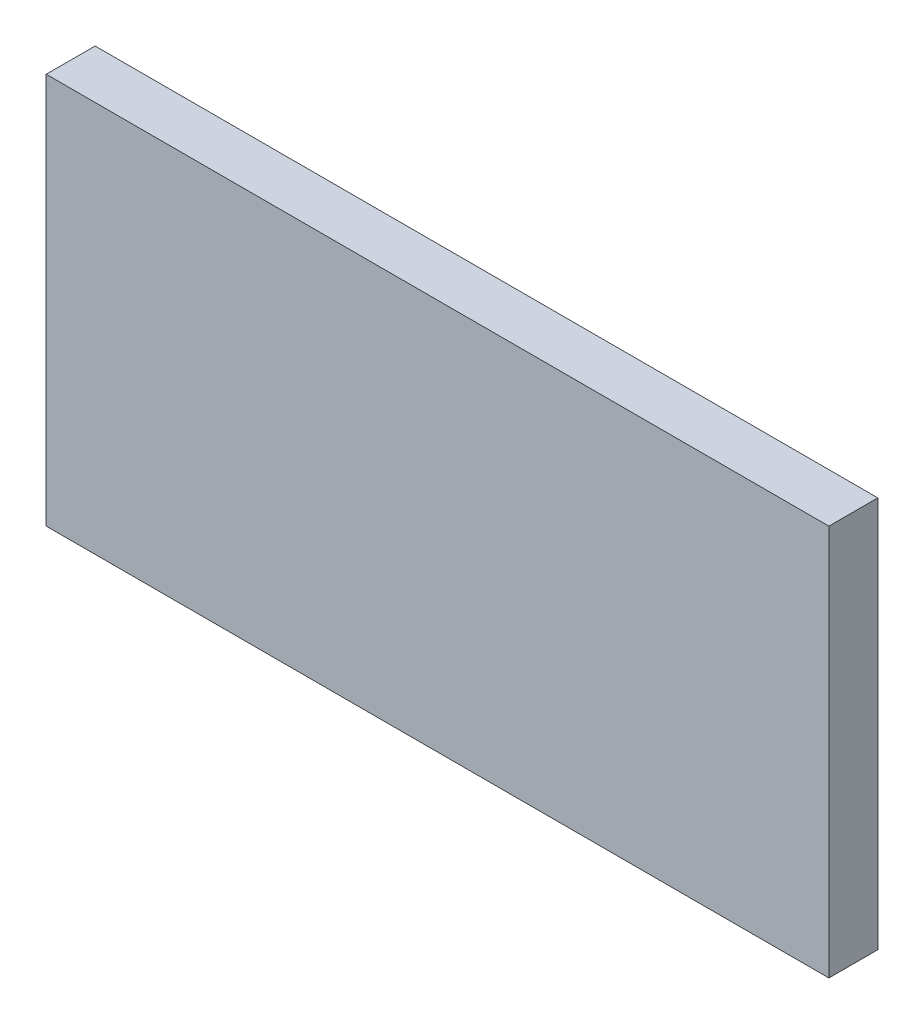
ISO-10303-21;
HEADER;
FILE_DESCRIPTION(('STEP AP214'),'2;1');
FILE_NAME('part.step','',(''),(''),'','','');
FILE_SCHEMA(('AUTOMOTIVE_DESIGN { 1 0 10303 214 1 1 1 1 }'));
ENDSEC;
DATA;
#1=APPLICATION_CONTEXT('core data for automotive mechanical design processes');
#2=APPLICATION_PROTOCOL_DEFINITION('international standard','automotive_design',2000,#1);
#3=PRODUCT_CONTEXT('',#1,'mechanical');
#4=PRODUCT('Part','Part','',(#3));
#5=PRODUCT_RELATED_PRODUCT_CATEGORY('part','',(#4));
#6=PRODUCT_DEFINITION_FORMATION('','',#4);
#7=PRODUCT_DEFINITION_CONTEXT('part definition',#1,'design');
#8=PRODUCT_DEFINITION('design','',#6,#7);
#9=PRODUCT_DEFINITION_SHAPE('','',#8);
#10=(LENGTH_UNIT() NAMED_UNIT(*) SI_UNIT(.MILLI.,.METRE.));
#11=(NAMED_UNIT(*) PLANE_ANGLE_UNIT() SI_UNIT($,.RADIAN.));
#12=(NAMED_UNIT(*) SI_UNIT($,.STERADIAN.) SOLID_ANGLE_UNIT());
#13=UNCERTAINTY_MEASURE_WITH_UNIT(LENGTH_MEASURE(1.E-05),#10,'distance_accuracy_value','');
#14=(GEOMETRIC_REPRESENTATION_CONTEXT(3) GLOBAL_UNCERTAINTY_ASSIGNED_CONTEXT((#13)) GLOBAL_UNIT_ASSIGNED_CONTEXT((#10,
#11,#12)) REPRESENTATION_CONTEXT('',''));
#15=CARTESIAN_POINT('',(0.,0.,0.));
#16=DIRECTION('',(0.,0.,1.));
#17=DIRECTION('',(1.,0.,0.));
#18=AXIS2_PLACEMENT_3D('',#15,#16,#17);
#19=CARTESIAN_POINT('',(0.,0.,0.));
#20=DIRECTION('',(0.,0.,1.));
#21=DIRECTION('',(1.,0.,0.));
#22=AXIS2_PLACEMENT_3D('',#19,#20,#21);
#23=PLANE('',#22);
#24=DIRECTION('',(0.,-1.,0.));
#25=VECTOR('',#24,1.);
#26=CARTESIAN_POINT('',(160.,40.,0.));
#27=LINE('',#26,#25);
#28=CARTESIAN_POINT('',(160.,40.,0.));
#29=VERTEX_POINT('',#28);
#30=CARTESIAN_POINT('',(160.,20.,0.));
#31=VERTEX_POINT('',#30);
#32=EDGE_CURVE('E55',#29,#31,#27,.T.);
#33=ORIENTED_EDGE('',*,*,#32,.F.);
#34=DIRECTION('',(1.,0.,0.));
#35=VECTOR('',#34,1.);
#36=CARTESIAN_POINT('',(160.,40.,0.));
#37=LINE('',#36,#35);
#38=CARTESIAN_POINT('',(100.,40.,0.));
#39=VERTEX_POINT('',#38);
#40=EDGE_CURVE('E204',#39,#29,#37,.T.);
#41=ORIENTED_EDGE('',*,*,#40,.F.);
#42=DIRECTION('',(0.,-1.,0.));
#43=VECTOR('',#42,1.);
#44=CARTESIAN_POINT('',(100.,40.,0.));
#45=LINE('',#44,#43);
#46=CARTESIAN_POINT('',(100.,20.,0.));
#47=VERTEX_POINT('',#46);
#48=EDGE_CURVE('E215',#39,#47,#45,.T.);
#49=ORIENTED_EDGE('',*,*,#48,.T.);
#50=DIRECTION('',(1.,0.,0.));
#51=VECTOR('',#50,1.);
#52=CARTESIAN_POINT('',(160.,20.,0.));
#53=LINE('',#52,#51);
#54=EDGE_CURVE('E202',#47,#31,#53,.T.);
#55=ORIENTED_EDGE('',*,*,#54,.T.);
#56=EDGE_LOOP('',(#33,#41,#49,#55));
#57=FACE_BOUND('',#56,.T.);
#58=DIRECTION('',(0.,-1.,0.));
#59=VECTOR('',#58,1.);
#60=CARTESIAN_POINT('',(-240.,40.,0.));
#61=LINE('',#60,#59);
#62=CARTESIAN_POINT('',(-240.,40.,0.));
#63=VERTEX_POINT('',#62);
#64=CARTESIAN_POINT('',(-240.,20.,0.));
#65=VERTEX_POINT('',#64);
#66=EDGE_CURVE('E302',#63,#65,#61,.T.);
#67=ORIENTED_EDGE('',*,*,#66,.F.);
#68=DIRECTION('',(1.,0.,0.));
#69=VECTOR('',#68,1.);
#70=CARTESIAN_POINT('',(-240.,40.,0.));
#71=LINE('',#70,#69);
#72=CARTESIAN_POINT('',(-300.,40.,0.));
#73=VERTEX_POINT('',#72);
#74=EDGE_CURVE('E276',#73,#63,#71,.T.);
#75=ORIENTED_EDGE('',*,*,#74,.F.);
#76=DIRECTION('',(0.,-1.,0.));
#77=VECTOR('',#76,1.);
#78=CARTESIAN_POINT('',(-300.,40.,0.));
#79=LINE('',#78,#77);
#80=CARTESIAN_POINT('',(-300.,20.,0.));
#81=VERTEX_POINT('',#80);
#82=EDGE_CURVE('E287',#73,#81,#79,.T.);
#83=ORIENTED_EDGE('',*,*,#82,.T.);
#84=DIRECTION('',(1.,0.,0.));
#85=VECTOR('',#84,1.);
#86=CARTESIAN_POINT('',(-240.,20.,0.));
#87=LINE('',#86,#85);
#88=EDGE_CURVE('E273',#81,#65,#87,.T.);
#89=ORIENTED_EDGE('',*,*,#88,.T.);
#90=EDGE_LOOP('',(#67,#75,#83,#89));
#91=FACE_BOUND('',#90,.T.);
#92=DIRECTION('',(0.,-1.,0.));
#93=VECTOR('',#92,1.);
#94=CARTESIAN_POINT('',(-400.,-200.,0.));
#95=LINE('',#94,#93);
#96=CARTESIAN_POINT('',(-400.,200.,0.));
#97=VERTEX_POINT('',#96);
#98=CARTESIAN_POINT('',(-400.,-200.,0.));
#99=VERTEX_POINT('',#98);
#100=EDGE_CURVE('E305',#97,#99,#95,.T.);
#101=ORIENTED_EDGE('',*,*,#100,.F.);
#102=DIRECTION('',(-1.,0.,0.));
#103=VECTOR('',#102,1.);
#104=CARTESIAN_POINT('',(400.,200.,0.));
#105=LINE('',#104,#103);
#106=CARTESIAN_POINT('',(400.,200.,0.));
#107=VERTEX_POINT('',#106);
#108=EDGE_CURVE('E310',#107,#97,#105,.T.);
#109=ORIENTED_EDGE('',*,*,#108,.F.);
#110=DIRECTION('',(0.,1.,0.));
#111=VECTOR('',#110,1.);
#112=CARTESIAN_POINT('',(400.,-200.,0.));
#113=LINE('',#112,#111);
#114=CARTESIAN_POINT('',(400.,-200.,0.));
#115=VERTEX_POINT('',#114);
#116=EDGE_CURVE('E321',#115,#107,#113,.T.);
#117=ORIENTED_EDGE('',*,*,#116,.F.);
#118=DIRECTION('',(1.,0.,0.));
#119=VECTOR('',#118,1.);
#120=CARTESIAN_POINT('',(400.,-200.,0.));
#121=LINE('',#120,#119);
#122=EDGE_CURVE('E319',#99,#115,#121,.T.);
#123=ORIENTED_EDGE('',*,*,#122,.F.);
#124=EDGE_LOOP('',(#101,#109,#117,#123));
#125=FACE_BOUND('',#124,.T.);
#126=DIRECTION('',(1.,0.,0.));
#127=VECTOR('',#126,1.);
#128=CARTESIAN_POINT('',(-240.,-40.,0.));
#129=LINE('',#128,#127);
#130=CARTESIAN_POINT('',(-300.,-40.,0.));
#131=VERTEX_POINT('',#130);
#132=CARTESIAN_POINT('',(-240.,-40.,0.));
#133=VERTEX_POINT('',#132);
#134=EDGE_CURVE('E238',#131,#133,#129,.T.);
#135=ORIENTED_EDGE('',*,*,#134,.T.);
#136=DIRECTION('',(0.,1.,0.));
#137=VECTOR('',#136,1.);
#138=CARTESIAN_POINT('',(-240.,-40.,0.));
#139=LINE('',#138,#137);
#140=CARTESIAN_POINT('',(-240.,-20.,0.));
#141=VERTEX_POINT('',#140);
#142=EDGE_CURVE('E251',#133,#141,#139,.T.);
#143=ORIENTED_EDGE('',*,*,#142,.T.);
#144=DIRECTION('',(1.,0.,0.));
#145=VECTOR('',#144,1.);
#146=CARTESIAN_POINT('',(-240.,-20.,0.));
#147=LINE('',#146,#145);
#148=CARTESIAN_POINT('',(-300.,-20.,0.));
#149=VERTEX_POINT('',#148);
#150=EDGE_CURVE('E235',#149,#141,#147,.T.);
#151=ORIENTED_EDGE('',*,*,#150,.F.);
#152=DIRECTION('',(0.,1.,0.));
#153=VECTOR('',#152,1.);
#154=CARTESIAN_POINT('',(-300.,-40.,0.));
#155=LINE('',#154,#153);
#156=EDGE_CURVE('E266',#131,#149,#155,.T.);
#157=ORIENTED_EDGE('',*,*,#156,.F.);
#158=EDGE_LOOP('',(#135,#143,#151,#157));
#159=FACE_BOUND('',#158,.T.);
#160=DIRECTION('',(1.,0.,0.));
#161=VECTOR('',#160,1.);
#162=CARTESIAN_POINT('',(160.,-40.,0.));
#163=LINE('',#162,#161);
#164=CARTESIAN_POINT('',(100.,-40.,0.));
#165=VERTEX_POINT('',#164);
#166=CARTESIAN_POINT('',(160.,-40.,0.));
#167=VERTEX_POINT('',#166);
#168=EDGE_CURVE('E171',#165,#167,#163,.T.);
#169=ORIENTED_EDGE('',*,*,#168,.T.);
#170=DIRECTION('',(0.,1.,0.));
#171=VECTOR('',#170,1.);
#172=CARTESIAN_POINT('',(160.,-40.,0.));
#173=LINE('',#172,#171);
#174=CARTESIAN_POINT('',(160.,-20.,0.));
#175=VERTEX_POINT('',#174);
#176=EDGE_CURVE('E500',#167,#175,#173,.T.);
#177=ORIENTED_EDGE('',*,*,#176,.T.);
#178=DIRECTION('',(1.,0.,0.));
#179=VECTOR('',#178,1.);
#180=CARTESIAN_POINT('',(160.,-20.,0.));
#181=LINE('',#180,#179);
#182=CARTESIAN_POINT('',(100.,-20.,0.));
#183=VERTEX_POINT('',#182);
#184=EDGE_CURVE('E191',#183,#175,#181,.T.);
#185=ORIENTED_EDGE('',*,*,#184,.F.);
#186=DIRECTION('',(0.,1.,0.));
#187=VECTOR('',#186,1.);
#188=CARTESIAN_POINT('',(100.,-40.,0.));
#189=LINE('',#188,#187);
#190=EDGE_CURVE('E186',#165,#183,#189,.T.);
#191=ORIENTED_EDGE('',*,*,#190,.F.);
#192=EDGE_LOOP('',(#169,#177,#185,#191));
#193=FACE_BOUND('',#192,.T.);
#194=ADVANCED_FACE('F32',(#57,#91,#125,#159,#193),#23,.F.);
#195=CARTESIAN_POINT('',(-400.,-200.,50.));
#196=DIRECTION('',(1.,0.,0.));
#197=DIRECTION('',(0.,0.,-1.));
#198=AXIS2_PLACEMENT_3D('',#195,#196,#197);
#199=PLANE('',#198);
#200=ORIENTED_EDGE('',*,*,#100,.T.);
#201=DIRECTION('',(0.,0.,-1.));
#202=VECTOR('',#201,1.);
#203=CARTESIAN_POINT('',(-400.,-200.,50.));
#204=LINE('',#203,#202);
#205=CARTESIAN_POINT('',(-400.,-200.,50.));
#206=VERTEX_POINT('',#205);
#207=EDGE_CURVE('E11',#206,#99,#204,.T.);
#208=ORIENTED_EDGE('',*,*,#207,.F.);
#209=DIRECTION('',(0.,-1.,0.));
#210=VECTOR('',#209,1.);
#211=CARTESIAN_POINT('',(-400.,-200.,50.));
#212=LINE('',#211,#210);
#213=CARTESIAN_POINT('',(-400.,200.,50.));
#214=VERTEX_POINT('',#213);
#215=EDGE_CURVE('E306',#214,#206,#212,.T.);
#216=ORIENTED_EDGE('',*,*,#215,.F.);
#217=DIRECTION('',(0.,0.,-1.));
#218=VECTOR('',#217,1.);
#219=CARTESIAN_POINT('',(-400.,200.,50.));
#220=LINE('',#219,#218);
#221=EDGE_CURVE('E316',#214,#97,#220,.T.);
#222=ORIENTED_EDGE('',*,*,#221,.T.);
#223=EDGE_LOOP('',(#200,#208,#216,#222));
#224=FACE_BOUND('',#223,.T.);
#225=ADVANCED_FACE('F34',(#224),#199,.F.);
#226=CARTESIAN_POINT('',(400.,-200.,50.));
#227=DIRECTION('',(0.,1.,0.));
#228=DIRECTION('',(-1.,0.,0.));
#229=AXIS2_PLACEMENT_3D('',#226,#227,#228);
#230=PLANE('',#229);
#231=ORIENTED_EDGE('',*,*,#122,.T.);
#232=DIRECTION('',(0.,0.,-1.));
#233=VECTOR('',#232,1.);
#234=CARTESIAN_POINT('',(400.,-200.,50.));
#235=LINE('',#234,#233);
#236=CARTESIAN_POINT('',(400.,-200.,50.));
#237=VERTEX_POINT('',#236);
#238=EDGE_CURVE('E40',#237,#115,#235,.T.);
#239=ORIENTED_EDGE('',*,*,#238,.F.);
#240=DIRECTION('',(1.,0.,0.));
#241=VECTOR('',#240,1.);
#242=CARTESIAN_POINT('',(400.,-200.,50.));
#243=LINE('',#242,#241);
#244=EDGE_CURVE('E309',#206,#237,#243,.T.);
#245=ORIENTED_EDGE('',*,*,#244,.F.);
#246=ORIENTED_EDGE('',*,*,#207,.T.);
#247=EDGE_LOOP('',(#231,#239,#245,#246));
#248=FACE_BOUND('',#247,.T.);
#249=ADVANCED_FACE('F349',(#248),#230,.F.);
#250=CARTESIAN_POINT('',(400.,-200.,50.));
#251=DIRECTION('',(-1.,0.,0.));
#252=DIRECTION('',(0.,0.,1.));
#253=AXIS2_PLACEMENT_3D('',#250,#251,#252);
#254=PLANE('',#253);
#255=ORIENTED_EDGE('',*,*,#116,.T.);
#256=DIRECTION('',(0.,0.,-1.));
#257=VECTOR('',#256,1.);
#258=CARTESIAN_POINT('',(400.,200.,50.));
#259=LINE('',#258,#257);
#260=CARTESIAN_POINT('',(400.,200.,50.));
#261=VERTEX_POINT('',#260);
#262=EDGE_CURVE('E326',#261,#107,#259,.T.);
#263=ORIENTED_EDGE('',*,*,#262,.F.);
#264=DIRECTION('',(0.,1.,0.));
#265=VECTOR('',#264,1.);
#266=CARTESIAN_POINT('',(400.,-200.,50.));
#267=LINE('',#266,#265);
#268=EDGE_CURVE('E312',#237,#261,#267,.T.);
#269=ORIENTED_EDGE('',*,*,#268,.F.);
#270=ORIENTED_EDGE('',*,*,#238,.T.);
#271=EDGE_LOOP('',(#255,#263,#269,#270));
#272=FACE_BOUND('',#271,.T.);
#273=ADVANCED_FACE('F333',(#272),#254,.F.);
#274=CARTESIAN_POINT('',(400.,200.,50.));
#275=DIRECTION('',(0.,-1.,0.));
#276=DIRECTION('',(1.,0.,0.));
#277=AXIS2_PLACEMENT_3D('',#274,#275,#276);
#278=PLANE('',#277);
#279=ORIENTED_EDGE('',*,*,#108,.T.);
#280=ORIENTED_EDGE('',*,*,#221,.F.);
#281=DIRECTION('',(-1.,0.,0.));
#282=VECTOR('',#281,1.);
#283=CARTESIAN_POINT('',(400.,200.,50.));
#284=LINE('',#283,#282);
#285=EDGE_CURVE('E314',#261,#214,#284,.T.);
#286=ORIENTED_EDGE('',*,*,#285,.F.);
#287=ORIENTED_EDGE('',*,*,#262,.T.);
#288=EDGE_LOOP('',(#279,#280,#286,#287));
#289=FACE_BOUND('',#288,.T.);
#290=ADVANCED_FACE('F342',(#289),#278,.F.);
#291=CARTESIAN_POINT('',(0.,0.,50.));
#292=DIRECTION('',(0.,0.,1.));
#293=DIRECTION('',(1.,0.,0.));
#294=AXIS2_PLACEMENT_3D('',#291,#292,#293);
#295=PLANE('',#294);
#296=ORIENTED_EDGE('',*,*,#215,.T.);
#297=ORIENTED_EDGE('',*,*,#244,.T.);
#298=ORIENTED_EDGE('',*,*,#268,.T.);
#299=ORIENTED_EDGE('',*,*,#285,.T.);
#300=EDGE_LOOP('',(#296,#297,#298,#299));
#301=FACE_BOUND('',#300,.T.);
#302=ADVANCED_FACE('F348',(#301),#295,.T.);
#303=CARTESIAN_POINT('',(-270.,40.,-60.));
#304=DIRECTION('',(0.,-1.,0.));
#305=DIRECTION('',(0.,0.,-1.));
#306=AXIS2_PLACEMENT_3D('',#303,#304,#305);
#307=PLANE('',#306);
#308=ORIENTED_EDGE('',*,*,#74,.T.);
#309=DIRECTION('',(0.,0.,-1.));
#310=VECTOR('',#309,1.);
#311=CARTESIAN_POINT('',(-240.,40.,-60.));
#312=LINE('',#311,#310);
#313=CARTESIAN_POINT('',(-240.,40.,-60.));
#314=VERTEX_POINT('',#313);
#315=EDGE_CURVE('E279',#63,#314,#312,.T.);
#316=ORIENTED_EDGE('',*,*,#315,.T.);
#317=CARTESIAN_POINT('',(-270.,40.,-60.));
#318=DIRECTION('',(0.,1.,0.));
#319=DIRECTION('',(0.,0.,-1.));
#320=AXIS2_PLACEMENT_3D('',#317,#318,#319);
#321=CIRCLE('',#320,30.);
#322=CARTESIAN_POINT('',(-300.,40.,-60.));
#323=VERTEX_POINT('',#322);
#324=EDGE_CURVE('E282',#314,#323,#321,.T.);
#325=ORIENTED_EDGE('',*,*,#324,.T.);
#326=DIRECTION('',(0.,0.,1.));
#327=VECTOR('',#326,1.);
#328=CARTESIAN_POINT('',(-300.,40.,0.));
#329=LINE('',#328,#327);
#330=EDGE_CURVE('E284',#323,#73,#329,.T.);
#331=ORIENTED_EDGE('',*,*,#330,.T.);
#332=EDGE_LOOP('',(#308,#316,#325,#331));
#333=FACE_BOUND('',#332,.T.);
#334=CARTESIAN_POINT('',(-270.,40.,-60.));
#335=DIRECTION('',(0.,1.,0.));
#336=DIRECTION('',(0.,0.,1.));
#337=AXIS2_PLACEMENT_3D('',#334,#335,#336);
#338=CIRCLE('',#337,20.);
#339=CARTESIAN_POINT('',(-270.,40.,-40.));
#340=VERTEX_POINT('',#339);
#341=EDGE_CURVE('E270',#340,#340,#338,.T.);
#342=ORIENTED_EDGE('',*,*,#341,.F.);
#343=EDGE_LOOP('',(#342));
#344=FACE_BOUND('',#343,.T.);
#345=ADVANCED_FACE('F368',(#333,#344),#307,.F.);
#346=CARTESIAN_POINT('',(-270.,20.,-60.));
#347=DIRECTION('',(0.,-1.,0.));
#348=DIRECTION('',(0.,0.,-1.));
#349=AXIS2_PLACEMENT_3D('',#346,#347,#348);
#350=PLANE('',#349);
#351=ORIENTED_EDGE('',*,*,#88,.F.);
#352=DIRECTION('',(0.,0.,1.));
#353=VECTOR('',#352,1.);
#354=CARTESIAN_POINT('',(-300.,20.,0.));
#355=LINE('',#354,#353);
#356=CARTESIAN_POINT('',(-300.,20.,-60.));
#357=VERTEX_POINT('',#356);
#358=EDGE_CURVE('E280',#357,#81,#355,.T.);
#359=ORIENTED_EDGE('',*,*,#358,.F.);
#360=CARTESIAN_POINT('',(-270.,20.,-60.));
#361=DIRECTION('',(0.,1.,0.));
#362=DIRECTION('',(0.,0.,-1.));
#363=AXIS2_PLACEMENT_3D('',#360,#361,#362);
#364=CIRCLE('',#363,30.);
#365=CARTESIAN_POINT('',(-240.,20.,-60.));
#366=VERTEX_POINT('',#365);
#367=EDGE_CURVE('E291',#366,#357,#364,.T.);
#368=ORIENTED_EDGE('',*,*,#367,.F.);
#369=DIRECTION('',(0.,0.,-1.));
#370=VECTOR('',#369,1.);
#371=CARTESIAN_POINT('',(-240.,20.,-60.));
#372=LINE('',#371,#370);
#373=EDGE_CURVE('E289',#65,#366,#372,.T.);
#374=ORIENTED_EDGE('',*,*,#373,.F.);
#375=EDGE_LOOP('',(#351,#359,#368,#374));
#376=FACE_BOUND('',#375,.T.);
#377=CARTESIAN_POINT('',(-270.,20.,-60.));
#378=DIRECTION('',(0.,1.,0.));
#379=DIRECTION('',(0.,0.,1.));
#380=AXIS2_PLACEMENT_3D('',#377,#378,#379);
#381=CIRCLE('',#380,20.);
#382=CARTESIAN_POINT('',(-270.,20.,-40.));
#383=VERTEX_POINT('',#382);
#384=EDGE_CURVE('E269',#383,#383,#381,.T.);
#385=ORIENTED_EDGE('',*,*,#384,.T.);
#386=EDGE_LOOP('',(#385));
#387=FACE_BOUND('',#386,.T.);
#388=ADVANCED_FACE('F372',(#376,#387),#350,.T.);
#389=CARTESIAN_POINT('',(-240.,40.,-60.));
#390=DIRECTION('',(-1.,0.,0.));
#391=DIRECTION('',(0.,0.,1.));
#392=AXIS2_PLACEMENT_3D('',#389,#390,#391);
#393=PLANE('',#392);
#394=ORIENTED_EDGE('',*,*,#373,.T.);
#395=DIRECTION('',(0.,-1.,0.));
#396=VECTOR('',#395,1.);
#397=CARTESIAN_POINT('',(-240.,40.,-60.));
#398=LINE('',#397,#396);
#399=EDGE_CURVE('E299',#314,#366,#398,.T.);
#400=ORIENTED_EDGE('',*,*,#399,.F.);
#401=ORIENTED_EDGE('',*,*,#315,.F.);
#402=ORIENTED_EDGE('',*,*,#66,.T.);
#403=EDGE_LOOP('',(#394,#400,#401,#402));
#404=FACE_BOUND('',#403,.T.);
#405=ADVANCED_FACE('F378',(#404),#393,.F.);
#406=CARTESIAN_POINT('',(-270.,40.,-60.));
#407=DIRECTION('',(0.,-1.,0.));
#408=DIRECTION('',(0.,0.,-1.));
#409=AXIS2_PLACEMENT_3D('',#406,#407,#408);
#410=CYLINDRICAL_SURFACE('',#409,30.);
#411=ORIENTED_EDGE('',*,*,#367,.T.);
#412=DIRECTION('',(0.,-1.,0.));
#413=VECTOR('',#412,1.);
#414=CARTESIAN_POINT('',(-300.,40.,-60.));
#415=LINE('',#414,#413);
#416=EDGE_CURVE('E296',#323,#357,#415,.T.);
#417=ORIENTED_EDGE('',*,*,#416,.F.);
#418=ORIENTED_EDGE('',*,*,#324,.F.);
#419=ORIENTED_EDGE('',*,*,#399,.T.);
#420=EDGE_LOOP('',(#411,#417,#418,#419));
#421=FACE_BOUND('',#420,.T.);
#422=ADVANCED_FACE('F389',(#421),#410,.T.);
#423=CARTESIAN_POINT('',(-300.,40.,0.));
#424=DIRECTION('',(1.,0.,0.));
#425=DIRECTION('',(0.,0.,-1.));
#426=AXIS2_PLACEMENT_3D('',#423,#424,#425);
#427=PLANE('',#426);
#428=ORIENTED_EDGE('',*,*,#358,.T.);
#429=ORIENTED_EDGE('',*,*,#82,.F.);
#430=ORIENTED_EDGE('',*,*,#330,.F.);
#431=ORIENTED_EDGE('',*,*,#416,.T.);
#432=EDGE_LOOP('',(#428,#429,#430,#431));
#433=FACE_BOUND('',#432,.T.);
#434=ADVANCED_FACE('F386',(#433),#427,.F.);
#435=CARTESIAN_POINT('',(-270.,40.,-60.));
#436=DIRECTION('',(0.,-1.,0.));
#437=DIRECTION('',(0.,0.,-1.));
#438=AXIS2_PLACEMENT_3D('',#435,#436,#437);
#439=CYLINDRICAL_SURFACE('',#438,20.);
#440=ORIENTED_EDGE('',*,*,#341,.T.);
#441=EDGE_LOOP('',(#440));
#442=FACE_BOUND('',#441,.T.);
#443=ORIENTED_EDGE('',*,*,#384,.F.);
#444=EDGE_LOOP('',(#443));
#445=FACE_BOUND('',#444,.T.);
#446=ADVANCED_FACE('F383',(#442,#445),#439,.F.);
#447=CARTESIAN_POINT('',(-300.,-40.,0.));
#448=DIRECTION('',(-1.,0.,0.));
#449=DIRECTION('',(0.,0.,1.));
#450=AXIS2_PLACEMENT_3D('',#447,#448,#449);
#451=PLANE('',#450);
#452=DIRECTION('',(0.,0.,1.));
#453=VECTOR('',#452,1.);
#454=CARTESIAN_POINT('',(-300.,-20.,0.));
#455=LINE('',#454,#453);
#456=CARTESIAN_POINT('',(-300.,-20.,-60.));
#457=VERTEX_POINT('',#456);
#458=EDGE_CURVE('E253',#457,#149,#455,.T.);
#459=ORIENTED_EDGE('',*,*,#458,.F.);
#460=DIRECTION('',(0.,1.,0.));
#461=VECTOR('',#460,1.);
#462=CARTESIAN_POINT('',(-300.,-40.,-60.));
#463=LINE('',#462,#461);
#464=CARTESIAN_POINT('',(-300.,-40.,-60.));
#465=VERTEX_POINT('',#464);
#466=EDGE_CURVE('E264',#465,#457,#463,.T.);
#467=ORIENTED_EDGE('',*,*,#466,.F.);
#468=DIRECTION('',(0.,0.,1.));
#469=VECTOR('',#468,1.);
#470=CARTESIAN_POINT('',(-300.,-40.,0.));
#471=LINE('',#470,#469);
#472=EDGE_CURVE('E241',#465,#131,#471,.T.);
#473=ORIENTED_EDGE('',*,*,#472,.T.);
#474=ORIENTED_EDGE('',*,*,#156,.T.);
#475=EDGE_LOOP('',(#459,#467,#473,#474));
#476=FACE_BOUND('',#475,.T.);
#477=ADVANCED_FACE('F411',(#476),#451,.T.);
#478=CARTESIAN_POINT('',(-270.,-40.,-60.));
#479=DIRECTION('',(0.,1.,0.));
#480=DIRECTION('',(0.,0.,1.));
#481=AXIS2_PLACEMENT_3D('',#478,#479,#480);
#482=CYLINDRICAL_SURFACE('',#481,30.);
#483=CARTESIAN_POINT('',(-270.,-20.,-60.));
#484=DIRECTION('',(0.,1.,0.));
#485=DIRECTION('',(0.,0.,-1.));
#486=AXIS2_PLACEMENT_3D('',#483,#484,#485);
#487=CIRCLE('',#486,30.);
#488=CARTESIAN_POINT('',(-240.,-20.,-60.));
#489=VERTEX_POINT('',#488);
#490=EDGE_CURVE('E255',#489,#457,#487,.T.);
#491=ORIENTED_EDGE('',*,*,#490,.F.);
#492=DIRECTION('',(0.,1.,0.));
#493=VECTOR('',#492,1.);
#494=CARTESIAN_POINT('',(-240.,-40.,-60.));
#495=LINE('',#494,#493);
#496=CARTESIAN_POINT('',(-240.,-40.,-60.));
#497=VERTEX_POINT('',#496);
#498=EDGE_CURVE('E262',#497,#489,#495,.T.);
#499=ORIENTED_EDGE('',*,*,#498,.F.);
#500=CARTESIAN_POINT('',(-270.,-40.,-60.));
#501=DIRECTION('',(0.,1.,0.));
#502=DIRECTION('',(0.,0.,-1.));
#503=AXIS2_PLACEMENT_3D('',#500,#501,#502);
#504=CIRCLE('',#503,30.);
#505=EDGE_CURVE('E245',#497,#465,#504,.T.);
#506=ORIENTED_EDGE('',*,*,#505,.T.);
#507=ORIENTED_EDGE('',*,*,#466,.T.);
#508=EDGE_LOOP('',(#491,#499,#506,#507));
#509=FACE_BOUND('',#508,.T.);
#510=ADVANCED_FACE('F416',(#509),#482,.T.);
#511=CARTESIAN_POINT('',(-240.,-40.,-60.));
#512=DIRECTION('',(1.,0.,0.));
#513=DIRECTION('',(0.,0.,-1.));
#514=AXIS2_PLACEMENT_3D('',#511,#512,#513);
#515=PLANE('',#514);
#516=DIRECTION('',(0.,0.,-1.));
#517=VECTOR('',#516,1.);
#518=CARTESIAN_POINT('',(-240.,-20.,-60.));
#519=LINE('',#518,#517);
#520=EDGE_CURVE('E242',#141,#489,#519,.T.);
#521=ORIENTED_EDGE('',*,*,#520,.F.);
#522=ORIENTED_EDGE('',*,*,#142,.F.);
#523=DIRECTION('',(0.,0.,-1.));
#524=VECTOR('',#523,1.);
#525=CARTESIAN_POINT('',(-240.,-40.,-60.));
#526=LINE('',#525,#524);
#527=EDGE_CURVE('E248',#133,#497,#526,.T.);
#528=ORIENTED_EDGE('',*,*,#527,.T.);
#529=ORIENTED_EDGE('',*,*,#498,.T.);
#530=EDGE_LOOP('',(#521,#522,#528,#529));
#531=FACE_BOUND('',#530,.T.);
#532=ADVANCED_FACE('F422',(#531),#515,.T.);
#533=CARTESIAN_POINT('',(-270.,-40.,-60.));
#534=DIRECTION('',(0.,1.,0.));
#535=DIRECTION('',(0.,0.,-1.));
#536=AXIS2_PLACEMENT_3D('',#533,#534,#535);
#537=PLANE('',#536);
#538=CARTESIAN_POINT('',(-270.,-40.,-60.));
#539=DIRECTION('',(0.,1.,0.));
#540=DIRECTION('',(0.,0.,1.));
#541=AXIS2_PLACEMENT_3D('',#538,#539,#540);
#542=CIRCLE('',#541,20.);
#543=CARTESIAN_POINT('',(-270.,-40.,-40.));
#544=VERTEX_POINT('',#543);
#545=EDGE_CURVE('E232',#544,#544,#542,.T.);
#546=ORIENTED_EDGE('',*,*,#545,.T.);
#547=EDGE_LOOP('',(#546));
#548=FACE_BOUND('',#547,.T.);
#549=ORIENTED_EDGE('',*,*,#134,.F.);
#550=ORIENTED_EDGE('',*,*,#472,.F.);
#551=ORIENTED_EDGE('',*,*,#505,.F.);
#552=ORIENTED_EDGE('',*,*,#527,.F.);
#553=EDGE_LOOP('',(#549,#550,#551,#552));
#554=FACE_BOUND('',#553,.T.);
#555=ADVANCED_FACE('F429',(#548,#554),#537,.F.);
#556=CARTESIAN_POINT('',(-270.,-20.,-60.));
#557=DIRECTION('',(0.,1.,0.));
#558=DIRECTION('',(0.,0.,-1.));
#559=AXIS2_PLACEMENT_3D('',#556,#557,#558);
#560=PLANE('',#559);
#561=CARTESIAN_POINT('',(-270.,-20.,-60.));
#562=DIRECTION('',(0.,1.,0.));
#563=DIRECTION('',(0.,0.,1.));
#564=AXIS2_PLACEMENT_3D('',#561,#562,#563);
#565=CIRCLE('',#564,20.);
#566=CARTESIAN_POINT('',(-270.,-20.,-40.));
#567=VERTEX_POINT('',#566);
#568=EDGE_CURVE('E231',#567,#567,#565,.T.);
#569=ORIENTED_EDGE('',*,*,#568,.F.);
#570=EDGE_LOOP('',(#569));
#571=FACE_BOUND('',#570,.T.);
#572=ORIENTED_EDGE('',*,*,#150,.T.);
#573=ORIENTED_EDGE('',*,*,#520,.T.);
#574=ORIENTED_EDGE('',*,*,#490,.T.);
#575=ORIENTED_EDGE('',*,*,#458,.T.);
#576=EDGE_LOOP('',(#572,#573,#574,#575));
#577=FACE_BOUND('',#576,.T.);
#578=ADVANCED_FACE('F431',(#571,#577),#560,.T.);
#579=CARTESIAN_POINT('',(-270.,-40.,-60.));
#580=DIRECTION('',(0.,1.,0.));
#581=DIRECTION('',(0.,0.,1.));
#582=AXIS2_PLACEMENT_3D('',#579,#580,#581);
#583=CYLINDRICAL_SURFACE('',#582,20.);
#584=ORIENTED_EDGE('',*,*,#545,.F.);
#585=EDGE_LOOP('',(#584));
#586=FACE_BOUND('',#585,.T.);
#587=ORIENTED_EDGE('',*,*,#568,.T.);
#588=EDGE_LOOP('',(#587));
#589=FACE_BOUND('',#588,.T.);
#590=ADVANCED_FACE('F434',(#586,#589),#583,.F.);
#591=CARTESIAN_POINT('',(130.,40.,-60.));
#592=DIRECTION('',(0.,-1.,0.));
#593=DIRECTION('',(0.,0.,-1.));
#594=AXIS2_PLACEMENT_3D('',#591,#592,#593);
#595=PLANE('',#594);
#596=ORIENTED_EDGE('',*,*,#40,.T.);
#597=DIRECTION('',(0.,0.,-1.));
#598=VECTOR('',#597,1.);
#599=CARTESIAN_POINT('',(160.,40.,-60.));
#600=LINE('',#599,#598);
#601=CARTESIAN_POINT('',(160.,40.,-60.));
#602=VERTEX_POINT('',#601);
#603=EDGE_CURVE('E207',#29,#602,#600,.T.);
#604=ORIENTED_EDGE('',*,*,#603,.T.);
#605=CARTESIAN_POINT('',(130.,40.,-60.));
#606=DIRECTION('',(0.,1.,0.));
#607=DIRECTION('',(0.,0.,-1.));
#608=AXIS2_PLACEMENT_3D('',#605,#606,#607);
#609=CIRCLE('',#608,30.);
#610=CARTESIAN_POINT('',(100.,40.,-60.));
#611=VERTEX_POINT('',#610);
#612=EDGE_CURVE('E210',#602,#611,#609,.T.);
#613=ORIENTED_EDGE('',*,*,#612,.T.);
#614=DIRECTION('',(0.,0.,1.));
#615=VECTOR('',#614,1.);
#616=CARTESIAN_POINT('',(100.,40.,0.));
#617=LINE('',#616,#615);
#618=EDGE_CURVE('E212',#611,#39,#617,.T.);
#619=ORIENTED_EDGE('',*,*,#618,.T.);
#620=EDGE_LOOP('',(#596,#604,#613,#619));
#621=FACE_BOUND('',#620,.T.);
#622=CARTESIAN_POINT('',(130.,40.,-60.));
#623=DIRECTION('',(0.,1.,0.));
#624=DIRECTION('',(0.,0.,1.));
#625=AXIS2_PLACEMENT_3D('',#622,#623,#624);
#626=CIRCLE('',#625,20.);
#627=CARTESIAN_POINT('',(130.,40.,-40.));
#628=VERTEX_POINT('',#627);
#629=EDGE_CURVE('E195',#628,#628,#626,.T.);
#630=ORIENTED_EDGE('',*,*,#629,.F.);
#631=EDGE_LOOP('',(#630));
#632=FACE_BOUND('',#631,.T.);
#633=ADVANCED_FACE('F441',(#621,#632),#595,.F.);
#634=CARTESIAN_POINT('',(130.,20.,-60.));
#635=DIRECTION('',(0.,-1.,0.));
#636=DIRECTION('',(0.,0.,-1.));
#637=AXIS2_PLACEMENT_3D('',#634,#635,#636);
#638=PLANE('',#637);
#639=ORIENTED_EDGE('',*,*,#54,.F.);
#640=DIRECTION('',(0.,0.,1.));
#641=VECTOR('',#640,1.);
#642=CARTESIAN_POINT('',(100.,20.,0.));
#643=LINE('',#642,#641);
#644=CARTESIAN_POINT('',(100.,20.,-60.));
#645=VERTEX_POINT('',#644);
#646=EDGE_CURVE('E208',#645,#47,#643,.T.);
#647=ORIENTED_EDGE('',*,*,#646,.F.);
#648=CARTESIAN_POINT('',(130.,20.,-60.));
#649=DIRECTION('',(0.,1.,0.));
#650=DIRECTION('',(0.,0.,-1.));
#651=AXIS2_PLACEMENT_3D('',#648,#649,#650);
#652=CIRCLE('',#651,30.);
#653=CARTESIAN_POINT('',(160.,20.,-60.));
#654=VERTEX_POINT('',#653);
#655=EDGE_CURVE('E219',#654,#645,#652,.T.);
#656=ORIENTED_EDGE('',*,*,#655,.F.);
#657=DIRECTION('',(0.,0.,-1.));
#658=VECTOR('',#657,1.);
#659=CARTESIAN_POINT('',(160.,20.,-60.));
#660=LINE('',#659,#658);
#661=EDGE_CURVE('E217',#31,#654,#660,.T.);
#662=ORIENTED_EDGE('',*,*,#661,.F.);
#663=EDGE_LOOP('',(#639,#647,#656,#662));
#664=FACE_BOUND('',#663,.T.);
#665=CARTESIAN_POINT('',(130.,20.,-60.));
#666=DIRECTION('',(0.,1.,0.));
#667=DIRECTION('',(0.,0.,1.));
#668=AXIS2_PLACEMENT_3D('',#665,#666,#667);
#669=CIRCLE('',#668,20.);
#670=CARTESIAN_POINT('',(130.,20.,-40.));
#671=VERTEX_POINT('',#670);
#672=EDGE_CURVE('E192',#671,#671,#669,.T.);
#673=ORIENTED_EDGE('',*,*,#672,.T.);
#674=EDGE_LOOP('',(#673));
#675=FACE_BOUND('',#674,.T.);
#676=ADVANCED_FACE('F447',(#664,#675),#638,.T.);
#677=CARTESIAN_POINT('',(160.,40.,-60.));
#678=DIRECTION('',(-1.,0.,0.));
#679=DIRECTION('',(0.,0.,1.));
#680=AXIS2_PLACEMENT_3D('',#677,#678,#679);
#681=PLANE('',#680);
#682=ORIENTED_EDGE('',*,*,#661,.T.);
#683=DIRECTION('',(0.,-1.,0.));
#684=VECTOR('',#683,1.);
#685=CARTESIAN_POINT('',(160.,40.,-60.));
#686=LINE('',#685,#684);
#687=EDGE_CURVE('E227',#602,#654,#686,.T.);
#688=ORIENTED_EDGE('',*,*,#687,.F.);
#689=ORIENTED_EDGE('',*,*,#603,.F.);
#690=ORIENTED_EDGE('',*,*,#32,.T.);
#691=EDGE_LOOP('',(#682,#688,#689,#690));
#692=FACE_BOUND('',#691,.T.);
#693=ADVANCED_FACE('F443',(#692),#681,.F.);
#694=CARTESIAN_POINT('',(130.,40.,-60.));
#695=DIRECTION('',(0.,-1.,0.));
#696=DIRECTION('',(0.,0.,-1.));
#697=AXIS2_PLACEMENT_3D('',#694,#695,#696);
#698=CYLINDRICAL_SURFACE('',#697,30.);
#699=ORIENTED_EDGE('',*,*,#655,.T.);
#700=DIRECTION('',(0.,-1.,0.));
#701=VECTOR('',#700,1.);
#702=CARTESIAN_POINT('',(100.,40.,-60.));
#703=LINE('',#702,#701);
#704=EDGE_CURVE('E224',#611,#645,#703,.T.);
#705=ORIENTED_EDGE('',*,*,#704,.F.);
#706=ORIENTED_EDGE('',*,*,#612,.F.);
#707=ORIENTED_EDGE('',*,*,#687,.T.);
#708=EDGE_LOOP('',(#699,#705,#706,#707));
#709=FACE_BOUND('',#708,.T.);
#710=ADVANCED_FACE('F446',(#709),#698,.T.);
#711=CARTESIAN_POINT('',(100.,40.,0.));
#712=DIRECTION('',(1.,0.,0.));
#713=DIRECTION('',(0.,0.,-1.));
#714=AXIS2_PLACEMENT_3D('',#711,#712,#713);
#715=PLANE('',#714);
#716=ORIENTED_EDGE('',*,*,#646,.T.);
#717=ORIENTED_EDGE('',*,*,#48,.F.);
#718=ORIENTED_EDGE('',*,*,#618,.F.);
#719=ORIENTED_EDGE('',*,*,#704,.T.);
#720=EDGE_LOOP('',(#716,#717,#718,#719));
#721=FACE_BOUND('',#720,.T.);
#722=ADVANCED_FACE('F451',(#721),#715,.F.);
#723=CARTESIAN_POINT('',(130.,40.,-60.));
#724=DIRECTION('',(0.,-1.,0.));
#725=DIRECTION('',(0.,0.,-1.));
#726=AXIS2_PLACEMENT_3D('',#723,#724,#725);
#727=CYLINDRICAL_SURFACE('',#726,20.);
#728=ORIENTED_EDGE('',*,*,#629,.T.);
#729=EDGE_LOOP('',(#728));
#730=FACE_BOUND('',#729,.T.);
#731=ORIENTED_EDGE('',*,*,#672,.F.);
#732=EDGE_LOOP('',(#731));
#733=FACE_BOUND('',#732,.T.);
#734=ADVANCED_FACE('F455',(#730,#733),#727,.F.);
#735=CARTESIAN_POINT('',(100.,-40.,0.));
#736=DIRECTION('',(-1.,0.,0.));
#737=DIRECTION('',(0.,0.,1.));
#738=AXIS2_PLACEMENT_3D('',#735,#736,#737);
#739=PLANE('',#738);
#740=DIRECTION('',(0.,0.,1.));
#741=VECTOR('',#740,1.);
#742=CARTESIAN_POINT('',(100.,-20.,0.));
#743=LINE('',#742,#741);
#744=CARTESIAN_POINT('',(100.,-20.,-60.));
#745=VERTEX_POINT('',#744);
#746=EDGE_CURVE('E47',#745,#183,#743,.T.);
#747=ORIENTED_EDGE('',*,*,#746,.F.);
#748=DIRECTION('',(0.,1.,0.));
#749=VECTOR('',#748,1.);
#750=CARTESIAN_POINT('',(100.,-40.,-60.));
#751=LINE('',#750,#749);
#752=CARTESIAN_POINT('',(100.,-40.,-60.));
#753=VERTEX_POINT('',#752);
#754=EDGE_CURVE('E188',#753,#745,#751,.T.);
#755=ORIENTED_EDGE('',*,*,#754,.F.);
#756=DIRECTION('',(0.,0.,1.));
#757=VECTOR('',#756,1.);
#758=CARTESIAN_POINT('',(100.,-40.,0.));
#759=LINE('',#758,#757);
#760=EDGE_CURVE('E175',#753,#165,#759,.T.);
#761=ORIENTED_EDGE('',*,*,#760,.T.);
#762=ORIENTED_EDGE('',*,*,#190,.T.);
#763=EDGE_LOOP('',(#747,#755,#761,#762));
#764=FACE_BOUND('',#763,.T.);
#765=ADVANCED_FACE('F185',(#764),#739,.T.);
#766=CARTESIAN_POINT('',(130.,-40.,-60.));
#767=DIRECTION('',(0.,1.,0.));
#768=DIRECTION('',(0.,0.,1.));
#769=AXIS2_PLACEMENT_3D('',#766,#767,#768);
#770=CYLINDRICAL_SURFACE('',#769,30.);
#771=CARTESIAN_POINT('',(130.,-20.,-60.));
#772=DIRECTION('',(0.,1.,0.));
#773=DIRECTION('',(0.,0.,-1.));
#774=AXIS2_PLACEMENT_3D('',#771,#772,#773);
#775=CIRCLE('',#774,30.);
#776=CARTESIAN_POINT('',(160.,-20.,-60.));
#777=VERTEX_POINT('',#776);
#778=EDGE_CURVE('E503',#777,#745,#775,.T.);
#779=ORIENTED_EDGE('',*,*,#778,.F.);
#780=DIRECTION('',(0.,1.,0.));
#781=VECTOR('',#780,1.);
#782=CARTESIAN_POINT('',(160.,-40.,-60.));
#783=LINE('',#782,#781);
#784=CARTESIAN_POINT('',(160.,-40.,-60.));
#785=VERTEX_POINT('',#784);
#786=EDGE_CURVE('E197',#785,#777,#783,.T.);
#787=ORIENTED_EDGE('',*,*,#786,.F.);
#788=CARTESIAN_POINT('',(130.,-40.,-60.));
#789=DIRECTION('',(0.,1.,0.));
#790=DIRECTION('',(0.,0.,-1.));
#791=AXIS2_PLACEMENT_3D('',#788,#789,#790);
#792=CIRCLE('',#791,30.);
#793=EDGE_CURVE('E189',#785,#753,#792,.T.);
#794=ORIENTED_EDGE('',*,*,#793,.T.);
#795=ORIENTED_EDGE('',*,*,#754,.T.);
#796=EDGE_LOOP('',(#779,#787,#794,#795));
#797=FACE_BOUND('',#796,.T.);
#798=ADVANCED_FACE('F468',(#797),#770,.T.);
#799=CARTESIAN_POINT('',(160.,-40.,-60.));
#800=DIRECTION('',(1.,0.,0.));
#801=DIRECTION('',(0.,0.,-1.));
#802=AXIS2_PLACEMENT_3D('',#799,#800,#801);
#803=PLANE('',#802);
#804=DIRECTION('',(0.,0.,-1.));
#805=VECTOR('',#804,1.);
#806=CARTESIAN_POINT('',(160.,-20.,-60.));
#807=LINE('',#806,#805);
#808=EDGE_CURVE('E182',#175,#777,#807,.T.);
#809=ORIENTED_EDGE('',*,*,#808,.F.);
#810=ORIENTED_EDGE('',*,*,#176,.F.);
#811=DIRECTION('',(0.,0.,-1.));
#812=VECTOR('',#811,1.);
#813=CARTESIAN_POINT('',(160.,-40.,-60.));
#814=LINE('',#813,#812);
#815=EDGE_CURVE('E178',#167,#785,#814,.T.);
#816=ORIENTED_EDGE('',*,*,#815,.T.);
#817=ORIENTED_EDGE('',*,*,#786,.T.);
#818=EDGE_LOOP('',(#809,#810,#816,#817));
#819=FACE_BOUND('',#818,.T.);
#820=ADVANCED_FACE('F471',(#819),#803,.T.);
#821=CARTESIAN_POINT('',(130.,-40.,-60.));
#822=DIRECTION('',(0.,1.,0.));
#823=DIRECTION('',(0.,0.,-1.));
#824=AXIS2_PLACEMENT_3D('',#821,#822,#823);
#825=PLANE('',#824);
#826=CARTESIAN_POINT('',(130.,-40.,-60.));
#827=DIRECTION('',(0.,1.,0.));
#828=DIRECTION('',(0.,0.,1.));
#829=AXIS2_PLACEMENT_3D('',#826,#827,#828);
#830=CIRCLE('',#829,20.);
#831=CARTESIAN_POINT('',(130.,-40.,-40.));
#832=VERTEX_POINT('',#831);
#833=EDGE_CURVE('E491',#832,#832,#830,.T.);
#834=ORIENTED_EDGE('',*,*,#833,.T.);
#835=EDGE_LOOP('',(#834));
#836=FACE_BOUND('',#835,.T.);
#837=ORIENTED_EDGE('',*,*,#168,.F.);
#838=ORIENTED_EDGE('',*,*,#760,.F.);
#839=ORIENTED_EDGE('',*,*,#793,.F.);
#840=ORIENTED_EDGE('',*,*,#815,.F.);
#841=EDGE_LOOP('',(#837,#838,#839,#840));
#842=FACE_BOUND('',#841,.T.);
#843=ADVANCED_FACE('F173',(#836,#842),#825,.F.);
#844=CARTESIAN_POINT('',(130.,-20.,-60.));
#845=DIRECTION('',(0.,1.,0.));
#846=DIRECTION('',(0.,0.,-1.));
#847=AXIS2_PLACEMENT_3D('',#844,#845,#846);
#848=PLANE('',#847);
#849=CARTESIAN_POINT('',(130.,-20.,-60.));
#850=DIRECTION('',(0.,1.,0.));
#851=DIRECTION('',(0.,0.,1.));
#852=AXIS2_PLACEMENT_3D('',#849,#850,#851);
#853=CIRCLE('',#852,20.);
#854=CARTESIAN_POINT('',(130.,-20.,-40.));
#855=VERTEX_POINT('',#854);
#856=EDGE_CURVE('E494',#855,#855,#853,.T.);
#857=ORIENTED_EDGE('',*,*,#856,.F.);
#858=EDGE_LOOP('',(#857));
#859=FACE_BOUND('',#858,.T.);
#860=ORIENTED_EDGE('',*,*,#184,.T.);
#861=ORIENTED_EDGE('',*,*,#808,.T.);
#862=ORIENTED_EDGE('',*,*,#778,.T.);
#863=ORIENTED_EDGE('',*,*,#746,.T.);
#864=EDGE_LOOP('',(#860,#861,#862,#863));
#865=FACE_BOUND('',#864,.T.);
#866=ADVANCED_FACE('F476',(#859,#865),#848,.T.);
#867=CARTESIAN_POINT('',(130.,-40.,-60.));
#868=DIRECTION('',(0.,1.,0.));
#869=DIRECTION('',(0.,0.,1.));
#870=AXIS2_PLACEMENT_3D('',#867,#868,#869);
#871=CYLINDRICAL_SURFACE('',#870,20.);
#872=ORIENTED_EDGE('',*,*,#833,.F.);
#873=EDGE_LOOP('',(#872));
#874=FACE_BOUND('',#873,.T.);
#875=ORIENTED_EDGE('',*,*,#856,.T.);
#876=EDGE_LOOP('',(#875));
#877=FACE_BOUND('',#876,.T.);
#878=ADVANCED_FACE('F479',(#874,#877),#871,.F.);
#879=CLOSED_SHELL('',(#194,#225,#249,#273,#290,#302,#345,#388,#405,#422,#434,#446,#477,#510,
#532,#555,#578,#590,#633,#676,#693,#710,#722,#734,#765,#798,#820,#843,#866,#878));
#880=MANIFOLD_SOLID_BREP('B2',#879);
#881=ADVANCED_BREP_SHAPE_REPRESENTATION('',(#18,#880),#14);
#882=SHAPE_DEFINITION_REPRESENTATION(#9,#881);
ENDSEC;
END-ISO-10303-21;
